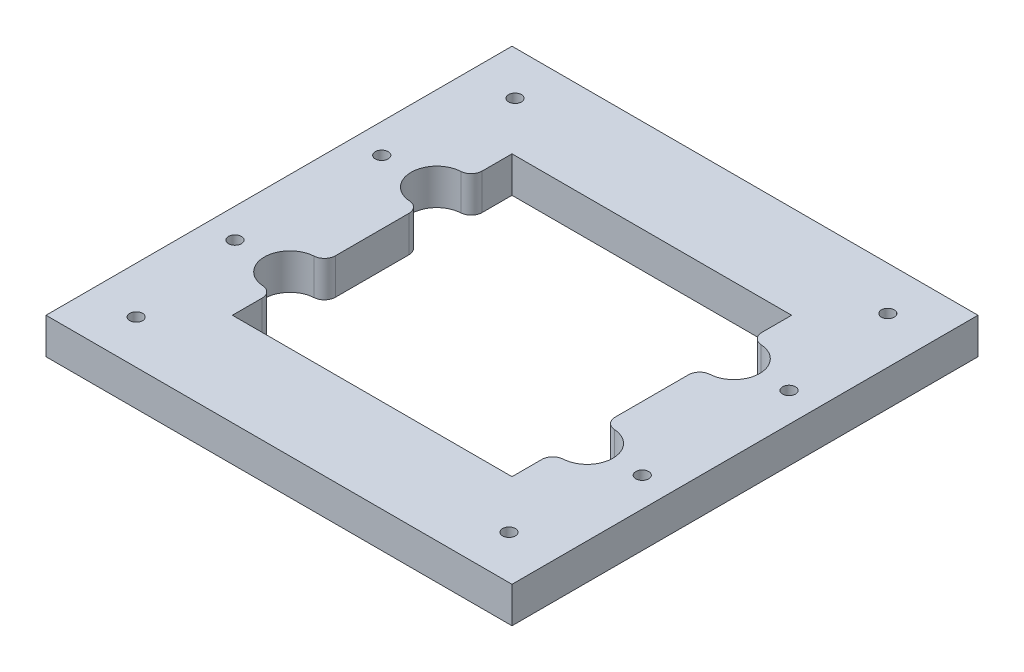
ISO-10303-21;
HEADER;
FILE_DESCRIPTION(('STEP AP214'),'2;1');
FILE_NAME('part.step','',(''),(''),'','','');
FILE_SCHEMA(('AUTOMOTIVE_DESIGN { 1 0 10303 214 1 1 1 1 }'));
ENDSEC;
DATA;
#1=APPLICATION_CONTEXT('core data for automotive mechanical design processes');
#2=APPLICATION_PROTOCOL_DEFINITION('international standard','automotive_design',2000,#1);
#3=PRODUCT_CONTEXT('',#1,'mechanical');
#4=PRODUCT('Part','Part','',(#3));
#5=PRODUCT_RELATED_PRODUCT_CATEGORY('part','',(#4));
#6=PRODUCT_DEFINITION_FORMATION('','',#4);
#7=PRODUCT_DEFINITION_CONTEXT('part definition',#1,'design');
#8=PRODUCT_DEFINITION('design','',#6,#7);
#9=PRODUCT_DEFINITION_SHAPE('','',#8);
#10=(LENGTH_UNIT() NAMED_UNIT(*) SI_UNIT(.MILLI.,.METRE.));
#11=(NAMED_UNIT(*) PLANE_ANGLE_UNIT() SI_UNIT($,.RADIAN.));
#12=(NAMED_UNIT(*) SI_UNIT($,.STERADIAN.) SOLID_ANGLE_UNIT());
#13=UNCERTAINTY_MEASURE_WITH_UNIT(LENGTH_MEASURE(1.E-05),#10,'distance_accuracy_value','');
#14=(GEOMETRIC_REPRESENTATION_CONTEXT(3) GLOBAL_UNCERTAINTY_ASSIGNED_CONTEXT((#13)) GLOBAL_UNIT_ASSIGNED_CONTEXT((#10,
#11,#12)) REPRESENTATION_CONTEXT('',''));
#15=CARTESIAN_POINT('',(0.,0.,0.));
#16=DIRECTION('',(0.,0.,1.));
#17=DIRECTION('',(1.,0.,0.));
#18=AXIS2_PLACEMENT_3D('',#15,#16,#17);
#19=CARTESIAN_POINT('',(19.05,8.075,19.05));
#20=DIRECTION('',(-1.,0.,0.));
#21=DIRECTION('',(0.,0.,1.));
#22=AXIS2_PLACEMENT_3D('',#19,#20,#21);
#23=PLANE('',#22);
#24=DIRECTION('',(0.,0.,-1.));
#25=VECTOR('',#24,1.);
#26=CARTESIAN_POINT('',(19.05,3.175,19.05));
#27=LINE('',#26,#25);
#28=CARTESIAN_POINT('',(19.05,3.175,5.00900811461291));
#29=VERTEX_POINT('',#28);
#30=CARTESIAN_POINT('',(19.05,3.175,-5.0090081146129));
#31=VERTEX_POINT('',#30);
#32=EDGE_CURVE('E234',#29,#31,#27,.T.);
#33=ORIENTED_EDGE('',*,*,#32,.F.);
#34=DIRECTION('',(0.,-1.,0.));
#35=VECTOR('',#34,1.);
#36=CARTESIAN_POINT('',(19.05,8.075,5.0090081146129));
#37=LINE('',#36,#35);
#38=CARTESIAN_POINT('',(19.05,8.075,5.00900811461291));
#39=VERTEX_POINT('',#38);
#40=EDGE_CURVE('E354',#29,#39,#37,.F.);
#41=ORIENTED_EDGE('',*,*,#40,.T.);
#42=DIRECTION('',(0.,0.,-1.));
#43=VECTOR('',#42,1.);
#44=CARTESIAN_POINT('',(19.05,8.075,19.05));
#45=LINE('',#44,#43);
#46=CARTESIAN_POINT('',(19.05,8.075,-5.0090081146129));
#47=VERTEX_POINT('',#46);
#48=EDGE_CURVE('E202',#39,#47,#45,.T.);
#49=ORIENTED_EDGE('',*,*,#48,.T.);
#50=DIRECTION('',(0.,-1.,0.));
#51=VECTOR('',#50,1.);
#52=CARTESIAN_POINT('',(19.05,3.175,-5.00900811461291));
#53=LINE('',#52,#51);
#54=EDGE_CURVE('E352',#47,#31,#53,.T.);
#55=ORIENTED_EDGE('',*,*,#54,.T.);
#56=EDGE_LOOP('',(#33,#41,#49,#55));
#57=FACE_BOUND('',#56,.T.);
#58=ADVANCED_FACE('F30',(#57),#23,.T.);
#59=CARTESIAN_POINT('',(19.05,8.075,19.05));
#60=VERTEX_POINT('',#59);
#61=CARTESIAN_POINT('',(19.05,8.075,14.9909918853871));
#62=VERTEX_POINT('',#61);
#63=EDGE_CURVE('E205',#60,#62,#45,.T.);
#64=ORIENTED_EDGE('',*,*,#63,.T.);
#65=DIRECTION('',(0.,-1.,0.));
#66=VECTOR('',#65,1.);
#67=CARTESIAN_POINT('',(19.05,3.175,14.9909918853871));
#68=LINE('',#67,#66);
#69=CARTESIAN_POINT('',(19.05,3.175,14.9909918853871));
#70=VERTEX_POINT('',#69);
#71=EDGE_CURVE('E350',#62,#70,#68,.T.);
#72=ORIENTED_EDGE('',*,*,#71,.T.);
#73=CARTESIAN_POINT('',(19.05,3.175,19.05));
#74=VERTEX_POINT('',#73);
#75=EDGE_CURVE('E232',#74,#70,#27,.T.);
#76=ORIENTED_EDGE('',*,*,#75,.F.);
#77=DIRECTION('',(0.,-1.,0.));
#78=VECTOR('',#77,1.);
#79=CARTESIAN_POINT('',(19.05,8.075,19.05));
#80=LINE('',#79,#78);
#81=EDGE_CURVE('E231',#60,#74,#80,.T.);
#82=ORIENTED_EDGE('',*,*,#81,.F.);
#83=EDGE_LOOP('',(#64,#72,#76,#82));
#84=FACE_BOUND('',#83,.T.);
#85=ADVANCED_FACE('F462',(#84),#23,.T.);
#86=CARTESIAN_POINT('',(-19.05,8.075,19.05));
#87=DIRECTION('',(1.,0.,0.));
#88=DIRECTION('',(0.,0.,-1.));
#89=AXIS2_PLACEMENT_3D('',#86,#87,#88);
#90=PLANE('',#89);
#91=DIRECTION('',(0.,0.,1.));
#92=VECTOR('',#91,1.);
#93=CARTESIAN_POINT('',(-19.05,3.175,19.05));
#94=LINE('',#93,#92);
#95=CARTESIAN_POINT('',(-19.05,3.175,-5.0090081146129));
#96=VERTEX_POINT('',#95);
#97=CARTESIAN_POINT('',(-19.05,3.175,5.0090081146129));
#98=VERTEX_POINT('',#97);
#99=EDGE_CURVE('E241',#96,#98,#94,.T.);
#100=ORIENTED_EDGE('',*,*,#99,.F.);
#101=DIRECTION('',(0.,-1.,0.));
#102=VECTOR('',#101,1.);
#103=CARTESIAN_POINT('',(-19.05,8.075,-5.00900811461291));
#104=LINE('',#103,#102);
#105=CARTESIAN_POINT('',(-19.05,8.075,-5.0090081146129));
#106=VERTEX_POINT('',#105);
#107=EDGE_CURVE('E335',#96,#106,#104,.F.);
#108=ORIENTED_EDGE('',*,*,#107,.T.);
#109=DIRECTION('',(0.,0.,1.));
#110=VECTOR('',#109,1.);
#111=CARTESIAN_POINT('',(-19.05,8.075,19.05));
#112=LINE('',#111,#110);
#113=CARTESIAN_POINT('',(-19.05,8.075,5.0090081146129));
#114=VERTEX_POINT('',#113);
#115=EDGE_CURVE('E224',#106,#114,#112,.T.);
#116=ORIENTED_EDGE('',*,*,#115,.T.);
#117=DIRECTION('',(0.,-1.,0.));
#118=VECTOR('',#117,1.);
#119=CARTESIAN_POINT('',(-19.05,3.175,5.0090081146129));
#120=LINE('',#119,#118);
#121=EDGE_CURVE('E333',#114,#98,#120,.T.);
#122=ORIENTED_EDGE('',*,*,#121,.T.);
#123=EDGE_LOOP('',(#100,#108,#116,#122));
#124=FACE_BOUND('',#123,.T.);
#125=ADVANCED_FACE('F468',(#124),#90,.T.);
#126=CARTESIAN_POINT('',(-19.05,8.075,-19.05));
#127=VERTEX_POINT('',#126);
#128=CARTESIAN_POINT('',(-19.05,8.075,-14.9909918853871));
#129=VERTEX_POINT('',#128);
#130=EDGE_CURVE('E221',#127,#129,#112,.T.);
#131=ORIENTED_EDGE('',*,*,#130,.T.);
#132=DIRECTION('',(0.,-1.,0.));
#133=VECTOR('',#132,1.);
#134=CARTESIAN_POINT('',(-19.05,3.175,-14.9909918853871));
#135=LINE('',#134,#133);
#136=CARTESIAN_POINT('',(-19.05,3.175,-14.9909918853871));
#137=VERTEX_POINT('',#136);
#138=EDGE_CURVE('E317',#129,#137,#135,.T.);
#139=ORIENTED_EDGE('',*,*,#138,.T.);
#140=CARTESIAN_POINT('',(-19.05,3.175,-19.05));
#141=VERTEX_POINT('',#140);
#142=EDGE_CURVE('E238',#141,#137,#94,.T.);
#143=ORIENTED_EDGE('',*,*,#142,.F.);
#144=DIRECTION('',(0.,-1.,0.));
#145=VECTOR('',#144,1.);
#146=CARTESIAN_POINT('',(-19.05,8.075,-19.05));
#147=LINE('',#146,#145);
#148=EDGE_CURVE('E214',#127,#141,#147,.T.);
#149=ORIENTED_EDGE('',*,*,#148,.F.);
#150=EDGE_LOOP('',(#131,#139,#143,#149));
#151=FACE_BOUND('',#150,.T.);
#152=ADVANCED_FACE('F430',(#151),#90,.T.);
#153=CARTESIAN_POINT('',(-31.75,8.075,31.75));
#154=DIRECTION('',(0.,1.,0.));
#155=DIRECTION('',(0.,0.,1.));
#156=AXIS2_PLACEMENT_3D('',#153,#154,#155);
#157=PLANE('',#156);
#158=CARTESIAN_POINT('',(-20.25,8.075,-10.));
#159=DIRECTION('',(0.,1.,0.));
#160=DIRECTION('',(0.,0.,1.));
#161=AXIS2_PLACEMENT_3D('',#158,#159,#160);
#162=CIRCLE('',#161,3.5);
#163=CARTESIAN_POINT('',(-20.46,8.075,-13.493694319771));
#164=VERTEX_POINT('',#163);
#165=CARTESIAN_POINT('',(-20.46,8.075,-6.50630568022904));
#166=VERTEX_POINT('',#165);
#167=EDGE_CURVE('E387',#164,#166,#162,.T.);
#168=ORIENTED_EDGE('',*,*,#167,.F.);
#169=CARTESIAN_POINT('',(-20.55,8.075,-14.9909918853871));
#170=DIRECTION('',(0.,1.,0.));
#171=DIRECTION('',(0.,0.,1.));
#172=AXIS2_PLACEMENT_3D('',#169,#170,#171);
#173=CIRCLE('',#172,1.5);
#174=EDGE_CURVE('E315',#164,#129,#173,.T.);
#175=ORIENTED_EDGE('',*,*,#174,.T.);
#176=ORIENTED_EDGE('',*,*,#130,.F.);
#177=DIRECTION('',(-1.,0.,0.));
#178=VECTOR('',#177,1.);
#179=CARTESIAN_POINT('',(19.05,8.075,-19.05));
#180=LINE('',#179,#178);
#181=CARTESIAN_POINT('',(19.05,8.075,-19.05));
#182=VERTEX_POINT('',#181);
#183=EDGE_CURVE('E209',#182,#127,#180,.T.);
#184=ORIENTED_EDGE('',*,*,#183,.F.);
#185=CARTESIAN_POINT('',(19.05,8.075,-14.9909918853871));
#186=VERTEX_POINT('',#185);
#187=EDGE_CURVE('E193',#186,#182,#45,.T.);
#188=ORIENTED_EDGE('',*,*,#187,.F.);
#189=CARTESIAN_POINT('',(20.55,8.075,-14.9909918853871));
#190=DIRECTION('',(0.,1.,0.));
#191=DIRECTION('',(0.,0.,1.));
#192=AXIS2_PLACEMENT_3D('',#189,#190,#191);
#193=CIRCLE('',#192,1.5);
#194=CARTESIAN_POINT('',(20.46,8.075,-13.493694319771));
#195=VERTEX_POINT('',#194);
#196=EDGE_CURVE('E303',#186,#195,#193,.T.);
#197=ORIENTED_EDGE('',*,*,#196,.T.);
#198=CARTESIAN_POINT('',(20.25,8.075,-10.));
#199=DIRECTION('',(0.,1.,0.));
#200=DIRECTION('',(0.,0.,1.));
#201=AXIS2_PLACEMENT_3D('',#198,#199,#200);
#202=CIRCLE('',#201,3.5);
#203=CARTESIAN_POINT('',(20.46,8.075,-6.50630568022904));
#204=VERTEX_POINT('',#203);
#205=EDGE_CURVE('E368',#204,#195,#202,.T.);
#206=ORIENTED_EDGE('',*,*,#205,.F.);
#207=CARTESIAN_POINT('',(20.55,8.075,-5.00900811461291));
#208=DIRECTION('',(0.,1.,0.));
#209=DIRECTION('',(0.,0.,1.));
#210=AXIS2_PLACEMENT_3D('',#207,#208,#209);
#211=CIRCLE('',#210,1.5);
#212=EDGE_CURVE('E301',#204,#47,#211,.T.);
#213=ORIENTED_EDGE('',*,*,#212,.T.);
#214=ORIENTED_EDGE('',*,*,#48,.F.);
#215=CARTESIAN_POINT('',(20.55,8.075,5.0090081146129));
#216=DIRECTION('',(0.,1.,0.));
#217=DIRECTION('',(0.,0.,1.));
#218=AXIS2_PLACEMENT_3D('',#215,#216,#217);
#219=CIRCLE('',#218,1.5);
#220=CARTESIAN_POINT('',(20.46,8.075,6.50630568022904));
#221=VERTEX_POINT('',#220);
#222=EDGE_CURVE('E305',#39,#221,#219,.T.);
#223=ORIENTED_EDGE('',*,*,#222,.T.);
#224=CARTESIAN_POINT('',(20.25,8.075,10.));
#225=DIRECTION('',(0.,1.,0.));
#226=DIRECTION('',(0.,0.,1.));
#227=AXIS2_PLACEMENT_3D('',#224,#225,#226);
#228=CIRCLE('',#227,3.5);
#229=CARTESIAN_POINT('',(20.46,8.075,13.493694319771));
#230=VERTEX_POINT('',#229);
#231=EDGE_CURVE('E373',#230,#221,#228,.T.);
#232=ORIENTED_EDGE('',*,*,#231,.F.);
#233=CARTESIAN_POINT('',(20.55,8.075,14.9909918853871));
#234=DIRECTION('',(0.,1.,0.));
#235=DIRECTION('',(0.,0.,1.));
#236=AXIS2_PLACEMENT_3D('',#233,#234,#235);
#237=CIRCLE('',#236,1.5);
#238=EDGE_CURVE('E307',#230,#62,#237,.T.);
#239=ORIENTED_EDGE('',*,*,#238,.T.);
#240=ORIENTED_EDGE('',*,*,#63,.F.);
#241=DIRECTION('',(1.,0.,0.));
#242=VECTOR('',#241,1.);
#243=CARTESIAN_POINT('',(19.05,8.075,19.05));
#244=LINE('',#243,#242);
#245=CARTESIAN_POINT('',(-19.05,8.075,19.05));
#246=VERTEX_POINT('',#245);
#247=EDGE_CURVE('E229',#246,#60,#244,.T.);
#248=ORIENTED_EDGE('',*,*,#247,.F.);
#249=CARTESIAN_POINT('',(-19.05,8.075,14.9909918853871));
#250=VERTEX_POINT('',#249);
#251=EDGE_CURVE('E222',#250,#246,#112,.T.);
#252=ORIENTED_EDGE('',*,*,#251,.F.);
#253=CARTESIAN_POINT('',(-20.55,8.075,14.9909918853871));
#254=DIRECTION('',(0.,1.,0.));
#255=DIRECTION('',(0.,0.,1.));
#256=AXIS2_PLACEMENT_3D('',#253,#254,#255);
#257=CIRCLE('',#256,1.5);
#258=CARTESIAN_POINT('',(-20.46,8.075,13.493694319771));
#259=VERTEX_POINT('',#258);
#260=EDGE_CURVE('E309',#250,#259,#257,.T.);
#261=ORIENTED_EDGE('',*,*,#260,.T.);
#262=CARTESIAN_POINT('',(-20.25,8.075,10.));
#263=DIRECTION('',(0.,1.,0.));
#264=DIRECTION('',(0.,0.,1.));
#265=AXIS2_PLACEMENT_3D('',#262,#263,#264);
#266=CIRCLE('',#265,3.5);
#267=CARTESIAN_POINT('',(-20.46,8.075,6.50630568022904));
#268=VERTEX_POINT('',#267);
#269=EDGE_CURVE('E381',#268,#259,#266,.T.);
#270=ORIENTED_EDGE('',*,*,#269,.F.);
#271=CARTESIAN_POINT('',(-20.55,8.075,5.0090081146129));
#272=DIRECTION('',(0.,1.,0.));
#273=DIRECTION('',(0.,0.,1.));
#274=AXIS2_PLACEMENT_3D('',#271,#272,#273);
#275=CIRCLE('',#274,1.5);
#276=EDGE_CURVE('E311',#268,#114,#275,.T.);
#277=ORIENTED_EDGE('',*,*,#276,.T.);
#278=ORIENTED_EDGE('',*,*,#115,.F.);
#279=CARTESIAN_POINT('',(-20.55,8.075,-5.00900811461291));
#280=DIRECTION('',(0.,1.,0.));
#281=DIRECTION('',(0.,0.,1.));
#282=AXIS2_PLACEMENT_3D('',#279,#280,#281);
#283=CIRCLE('',#282,1.5);
#284=EDGE_CURVE('E313',#106,#166,#283,.T.);
#285=ORIENTED_EDGE('',*,*,#284,.T.);
#286=EDGE_LOOP('',(#168,#175,#176,#184,#188,#197,#206,#213,#214,#223,#232,#239,#240,#248,#252,
#261,#270,#277,#278,#285));
#287=FACE_BOUND('',#286,.T.);
#288=CARTESIAN_POINT('',(-27.75,8.075,-10.));
#289=DIRECTION('',(0.,1.,0.));
#290=DIRECTION('',(0.,0.,1.));
#291=AXIS2_PLACEMENT_3D('',#288,#289,#290);
#292=CIRCLE('',#291,0.875000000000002);
#293=CARTESIAN_POINT('',(-27.75,8.075,-10.875));
#294=VERTEX_POINT('',#293);
#295=EDGE_CURVE('E396',#294,#294,#292,.T.);
#296=ORIENTED_EDGE('',*,*,#295,.F.);
#297=EDGE_LOOP('',(#296));
#298=FACE_BOUND('',#297,.T.);
#299=CARTESIAN_POINT('',(27.75,8.075,-10.));
#300=DIRECTION('',(0.,1.,0.));
#301=DIRECTION('',(0.,0.,1.));
#302=AXIS2_PLACEMENT_3D('',#299,#300,#301);
#303=CIRCLE('',#302,0.875000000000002);
#304=CARTESIAN_POINT('',(27.75,8.075,-10.875));
#305=VERTEX_POINT('',#304);
#306=EDGE_CURVE('E402',#305,#305,#303,.T.);
#307=ORIENTED_EDGE('',*,*,#306,.F.);
#308=EDGE_LOOP('',(#307));
#309=FACE_BOUND('',#308,.T.);
#310=CARTESIAN_POINT('',(27.75,8.075,10.));
#311=DIRECTION('',(0.,1.,0.));
#312=DIRECTION('',(0.,0.,1.));
#313=AXIS2_PLACEMENT_3D('',#310,#311,#312);
#314=CIRCLE('',#313,0.875000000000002);
#315=CARTESIAN_POINT('',(27.75,8.075,9.125));
#316=VERTEX_POINT('',#315);
#317=EDGE_CURVE('E408',#316,#316,#314,.T.);
#318=ORIENTED_EDGE('',*,*,#317,.F.);
#319=EDGE_LOOP('',(#318));
#320=FACE_BOUND('',#319,.T.);
#321=CARTESIAN_POINT('',(-27.75,8.075,10.));
#322=DIRECTION('',(0.,1.,0.));
#323=DIRECTION('',(0.,0.,1.));
#324=AXIS2_PLACEMENT_3D('',#321,#322,#323);
#325=CIRCLE('',#324,0.875000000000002);
#326=CARTESIAN_POINT('',(-27.75,8.075,9.125));
#327=VERTEX_POINT('',#326);
#328=EDGE_CURVE('E414',#327,#327,#325,.T.);
#329=ORIENTED_EDGE('',*,*,#328,.F.);
#330=EDGE_LOOP('',(#329));
#331=FACE_BOUND('',#330,.T.);
#332=CARTESIAN_POINT('',(-25.4,8.075,25.8125));
#333=DIRECTION('',(0.,1.,0.));
#334=DIRECTION('',(0.,0.,1.));
#335=AXIS2_PLACEMENT_3D('',#332,#333,#334);
#336=CIRCLE('',#335,0.875000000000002);
#337=CARTESIAN_POINT('',(-25.4,8.075,26.6875));
#338=VERTEX_POINT('',#337);
#339=EDGE_CURVE('E295',#338,#338,#336,.T.);
#340=ORIENTED_EDGE('',*,*,#339,.F.);
#341=EDGE_LOOP('',(#340));
#342=FACE_BOUND('',#341,.T.);
#343=CARTESIAN_POINT('',(25.4,8.075,25.8125));
#344=DIRECTION('',(0.,1.,0.));
#345=DIRECTION('',(0.,0.,1.));
#346=AXIS2_PLACEMENT_3D('',#343,#344,#345);
#347=CIRCLE('',#346,0.875000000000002);
#348=CARTESIAN_POINT('',(25.4,8.075,26.6875));
#349=VERTEX_POINT('',#348);
#350=EDGE_CURVE('E291',#349,#349,#347,.T.);
#351=ORIENTED_EDGE('',*,*,#350,.F.);
#352=EDGE_LOOP('',(#351));
#353=FACE_BOUND('',#352,.T.);
#354=CARTESIAN_POINT('',(25.4,8.075,-25.8125));
#355=DIRECTION('',(0.,1.,0.));
#356=DIRECTION('',(0.,0.,1.));
#357=AXIS2_PLACEMENT_3D('',#354,#355,#356);
#358=CIRCLE('',#357,0.875000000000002);
#359=CARTESIAN_POINT('',(25.4,8.075,-24.9375));
#360=VERTEX_POINT('',#359);
#361=EDGE_CURVE('E287',#360,#360,#358,.T.);
#362=ORIENTED_EDGE('',*,*,#361,.F.);
#363=EDGE_LOOP('',(#362));
#364=FACE_BOUND('',#363,.T.);
#365=CARTESIAN_POINT('',(-25.4,8.075,-25.8125));
#366=DIRECTION('',(0.,1.,0.));
#367=DIRECTION('',(0.,0.,1.));
#368=AXIS2_PLACEMENT_3D('',#365,#366,#367);
#369=CIRCLE('',#368,0.875000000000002);
#370=CARTESIAN_POINT('',(-25.4,8.075,-24.9375));
#371=VERTEX_POINT('',#370);
#372=EDGE_CURVE('E283',#371,#371,#369,.T.);
#373=ORIENTED_EDGE('',*,*,#372,.F.);
#374=EDGE_LOOP('',(#373));
#375=FACE_BOUND('',#374,.T.);
#376=DIRECTION('',(0.,0.,1.));
#377=VECTOR('',#376,1.);
#378=CARTESIAN_POINT('',(-31.75,8.075,-31.75));
#379=LINE('',#378,#377);
#380=CARTESIAN_POINT('',(-31.75,8.075,-31.75));
#381=VERTEX_POINT('',#380);
#382=CARTESIAN_POINT('',(-31.75,8.075,31.75));
#383=VERTEX_POINT('',#382);
#384=EDGE_CURVE('E250',#381,#383,#379,.T.);
#385=ORIENTED_EDGE('',*,*,#384,.T.);
#386=DIRECTION('',(1.,0.,0.));
#387=VECTOR('',#386,1.);
#388=CARTESIAN_POINT('',(-31.75,8.075,31.75));
#389=LINE('',#388,#387);
#390=CARTESIAN_POINT('',(31.75,8.075,31.75));
#391=VERTEX_POINT('',#390);
#392=EDGE_CURVE('E253',#383,#391,#389,.T.);
#393=ORIENTED_EDGE('',*,*,#392,.T.);
#394=DIRECTION('',(0.,0.,-1.));
#395=VECTOR('',#394,1.);
#396=CARTESIAN_POINT('',(31.75,8.075,-31.75));
#397=LINE('',#396,#395);
#398=CARTESIAN_POINT('',(31.75,8.075,-31.75));
#399=VERTEX_POINT('',#398);
#400=EDGE_CURVE('E256',#391,#399,#397,.T.);
#401=ORIENTED_EDGE('',*,*,#400,.T.);
#402=DIRECTION('',(-1.,0.,0.));
#403=VECTOR('',#402,1.);
#404=CARTESIAN_POINT('',(-31.75,8.075,-31.75));
#405=LINE('',#404,#403);
#406=EDGE_CURVE('E258',#399,#381,#405,.T.);
#407=ORIENTED_EDGE('',*,*,#406,.T.);
#408=EDGE_LOOP('',(#385,#393,#401,#407));
#409=FACE_BOUND('',#408,.T.);
#410=ADVANCED_FACE('F218',(#287,#298,#309,#320,#331,#342,#353,#364,#375,#409),#157,.T.);
#411=CARTESIAN_POINT('',(-31.75,3.175,31.75));
#412=DIRECTION('',(0.,1.,0.));
#413=DIRECTION('',(0.,0.,1.));
#414=AXIS2_PLACEMENT_3D('',#411,#412,#413);
#415=PLANE('',#414);
#416=CARTESIAN_POINT('',(-27.75,3.175,-10.));
#417=DIRECTION('',(0.,-1.,0.));
#418=DIRECTION('',(0.,0.,-1.));
#419=AXIS2_PLACEMENT_3D('',#416,#417,#418);
#420=CIRCLE('',#419,0.875000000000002);
#421=CARTESIAN_POINT('',(-27.75,3.17499999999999,-10.875));
#422=VERTEX_POINT('',#421);
#423=EDGE_CURVE('E393',#422,#422,#420,.T.);
#424=ORIENTED_EDGE('',*,*,#423,.F.);
#425=EDGE_LOOP('',(#424));
#426=FACE_BOUND('',#425,.T.);
#427=CARTESIAN_POINT('',(27.75,3.175,-10.));
#428=DIRECTION('',(0.,-1.,0.));
#429=DIRECTION('',(0.,0.,-1.));
#430=AXIS2_PLACEMENT_3D('',#427,#428,#429);
#431=CIRCLE('',#430,0.875000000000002);
#432=CARTESIAN_POINT('',(27.75,3.17499999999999,-10.875));
#433=VERTEX_POINT('',#432);
#434=EDGE_CURVE('E399',#433,#433,#431,.T.);
#435=ORIENTED_EDGE('',*,*,#434,.F.);
#436=EDGE_LOOP('',(#435));
#437=FACE_BOUND('',#436,.T.);
#438=CARTESIAN_POINT('',(27.75,3.175,10.));
#439=DIRECTION('',(0.,-1.,0.));
#440=DIRECTION('',(0.,0.,-1.));
#441=AXIS2_PLACEMENT_3D('',#438,#439,#440);
#442=CIRCLE('',#441,0.875000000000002);
#443=CARTESIAN_POINT('',(27.75,3.17499999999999,9.125));
#444=VERTEX_POINT('',#443);
#445=EDGE_CURVE('E405',#444,#444,#442,.T.);
#446=ORIENTED_EDGE('',*,*,#445,.F.);
#447=EDGE_LOOP('',(#446));
#448=FACE_BOUND('',#447,.T.);
#449=CARTESIAN_POINT('',(-27.75,3.175,10.));
#450=DIRECTION('',(0.,-1.,0.));
#451=DIRECTION('',(0.,0.,-1.));
#452=AXIS2_PLACEMENT_3D('',#449,#450,#451);
#453=CIRCLE('',#452,0.875000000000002);
#454=CARTESIAN_POINT('',(-27.75,3.17499999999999,9.125));
#455=VERTEX_POINT('',#454);
#456=EDGE_CURVE('E411',#455,#455,#453,.T.);
#457=ORIENTED_EDGE('',*,*,#456,.F.);
#458=EDGE_LOOP('',(#457));
#459=FACE_BOUND('',#458,.T.);
#460=CARTESIAN_POINT('',(-25.4,3.175,25.8125));
#461=DIRECTION('',(0.,1.,0.));
#462=DIRECTION('',(0.,0.,1.));
#463=AXIS2_PLACEMENT_3D('',#460,#461,#462);
#464=CIRCLE('',#463,0.875000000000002);
#465=CARTESIAN_POINT('',(-25.4,3.175,26.6875));
#466=VERTEX_POINT('',#465);
#467=EDGE_CURVE('E292',#466,#466,#464,.T.);
#468=ORIENTED_EDGE('',*,*,#467,.T.);
#469=EDGE_LOOP('',(#468));
#470=FACE_BOUND('',#469,.T.);
#471=CARTESIAN_POINT('',(25.4,3.175,25.8125));
#472=DIRECTION('',(0.,1.,0.));
#473=DIRECTION('',(0.,0.,1.));
#474=AXIS2_PLACEMENT_3D('',#471,#472,#473);
#475=CIRCLE('',#474,0.875000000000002);
#476=CARTESIAN_POINT('',(25.4,3.175,26.6875));
#477=VERTEX_POINT('',#476);
#478=EDGE_CURVE('E288',#477,#477,#475,.T.);
#479=ORIENTED_EDGE('',*,*,#478,.T.);
#480=EDGE_LOOP('',(#479));
#481=FACE_BOUND('',#480,.T.);
#482=CARTESIAN_POINT('',(25.4,3.175,-25.8125));
#483=DIRECTION('',(0.,1.,0.));
#484=DIRECTION('',(0.,0.,1.));
#485=AXIS2_PLACEMENT_3D('',#482,#483,#484);
#486=CIRCLE('',#485,0.875000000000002);
#487=CARTESIAN_POINT('',(25.4,3.175,-24.9375));
#488=VERTEX_POINT('',#487);
#489=EDGE_CURVE('E284',#488,#488,#486,.T.);
#490=ORIENTED_EDGE('',*,*,#489,.T.);
#491=EDGE_LOOP('',(#490));
#492=FACE_BOUND('',#491,.T.);
#493=CARTESIAN_POINT('',(-25.4,3.175,-25.8125));
#494=DIRECTION('',(0.,1.,0.));
#495=DIRECTION('',(0.,0.,1.));
#496=AXIS2_PLACEMENT_3D('',#493,#494,#495);
#497=CIRCLE('',#496,0.875000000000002);
#498=CARTESIAN_POINT('',(-25.4,3.175,-24.9375));
#499=VERTEX_POINT('',#498);
#500=EDGE_CURVE('E280',#499,#499,#497,.T.);
#501=ORIENTED_EDGE('',*,*,#500,.T.);
#502=EDGE_LOOP('',(#501));
#503=FACE_BOUND('',#502,.T.);
#504=DIRECTION('',(0.,0.,1.));
#505=VECTOR('',#504,1.);
#506=CARTESIAN_POINT('',(-31.75,3.175,-31.75));
#507=LINE('',#506,#505);
#508=CARTESIAN_POINT('',(-31.75,3.175,-31.75));
#509=VERTEX_POINT('',#508);
#510=CARTESIAN_POINT('',(-31.75,3.175,31.75));
#511=VERTEX_POINT('',#510);
#512=EDGE_CURVE('E213',#509,#511,#507,.T.);
#513=ORIENTED_EDGE('',*,*,#512,.F.);
#514=DIRECTION('',(-1.,0.,0.));
#515=VECTOR('',#514,1.);
#516=CARTESIAN_POINT('',(-31.75,3.175,-31.75));
#517=LINE('',#516,#515);
#518=CARTESIAN_POINT('',(31.75,3.175,-31.75));
#519=VERTEX_POINT('',#518);
#520=EDGE_CURVE('E254',#519,#509,#517,.T.);
#521=ORIENTED_EDGE('',*,*,#520,.F.);
#522=DIRECTION('',(0.,0.,-1.));
#523=VECTOR('',#522,1.);
#524=CARTESIAN_POINT('',(31.75,3.175,-31.75));
#525=LINE('',#524,#523);
#526=CARTESIAN_POINT('',(31.75,3.175,31.75));
#527=VERTEX_POINT('',#526);
#528=EDGE_CURVE('E265',#527,#519,#525,.T.);
#529=ORIENTED_EDGE('',*,*,#528,.F.);
#530=DIRECTION('',(1.,0.,0.));
#531=VECTOR('',#530,1.);
#532=CARTESIAN_POINT('',(-31.75,3.175,31.75));
#533=LINE('',#532,#531);
#534=EDGE_CURVE('E263',#511,#527,#533,.T.);
#535=ORIENTED_EDGE('',*,*,#534,.F.);
#536=EDGE_LOOP('',(#513,#521,#529,#535));
#537=FACE_BOUND('',#536,.T.);
#538=ORIENTED_EDGE('',*,*,#142,.T.);
#539=CARTESIAN_POINT('',(-20.55,3.175,-14.9909918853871));
#540=DIRECTION('',(0.,1.,0.));
#541=DIRECTION('',(0.,0.,1.));
#542=AXIS2_PLACEMENT_3D('',#539,#540,#541);
#543=CIRCLE('',#542,1.5);
#544=CARTESIAN_POINT('',(-20.46,3.175,-13.493694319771));
#545=VERTEX_POINT('',#544);
#546=EDGE_CURVE('E331',#137,#545,#543,.F.);
#547=ORIENTED_EDGE('',*,*,#546,.T.);
#548=CARTESIAN_POINT('',(-20.25,3.175,-10.));
#549=DIRECTION('',(0.,1.,0.));
#550=DIRECTION('',(0.,0.,1.));
#551=AXIS2_PLACEMENT_3D('',#548,#549,#550);
#552=CIRCLE('',#551,3.5);
#553=CARTESIAN_POINT('',(-20.46,3.175,-6.50630568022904));
#554=VERTEX_POINT('',#553);
#555=EDGE_CURVE('E390',#545,#554,#552,.T.);
#556=ORIENTED_EDGE('',*,*,#555,.T.);
#557=CARTESIAN_POINT('',(-20.55,3.175,-5.00900811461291));
#558=DIRECTION('',(0.,1.,0.));
#559=DIRECTION('',(0.,0.,1.));
#560=AXIS2_PLACEMENT_3D('',#557,#558,#559);
#561=CIRCLE('',#560,1.5);
#562=EDGE_CURVE('E329',#554,#96,#561,.F.);
#563=ORIENTED_EDGE('',*,*,#562,.T.);
#564=ORIENTED_EDGE('',*,*,#99,.T.);
#565=CARTESIAN_POINT('',(-20.55,3.175,5.0090081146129));
#566=DIRECTION('',(0.,1.,0.));
#567=DIRECTION('',(0.,0.,1.));
#568=AXIS2_PLACEMENT_3D('',#565,#566,#567);
#569=CIRCLE('',#568,1.5);
#570=CARTESIAN_POINT('',(-20.46,3.175,6.50630568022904));
#571=VERTEX_POINT('',#570);
#572=EDGE_CURVE('E327',#98,#571,#569,.F.);
#573=ORIENTED_EDGE('',*,*,#572,.T.);
#574=CARTESIAN_POINT('',(-20.25,3.175,10.));
#575=DIRECTION('',(0.,1.,0.));
#576=DIRECTION('',(0.,0.,1.));
#577=AXIS2_PLACEMENT_3D('',#574,#575,#576);
#578=CIRCLE('',#577,3.5);
#579=CARTESIAN_POINT('',(-20.46,3.175,13.493694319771));
#580=VERTEX_POINT('',#579);
#581=EDGE_CURVE('E384',#571,#580,#578,.T.);
#582=ORIENTED_EDGE('',*,*,#581,.T.);
#583=CARTESIAN_POINT('',(-20.55,3.175,14.9909918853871));
#584=DIRECTION('',(0.,1.,0.));
#585=DIRECTION('',(0.,0.,1.));
#586=AXIS2_PLACEMENT_3D('',#583,#584,#585);
#587=CIRCLE('',#586,1.5);
#588=CARTESIAN_POINT('',(-19.05,3.175,14.9909918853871));
#589=VERTEX_POINT('',#588);
#590=EDGE_CURVE('E325',#580,#589,#587,.F.);
#591=ORIENTED_EDGE('',*,*,#590,.T.);
#592=CARTESIAN_POINT('',(-19.05,3.175,19.05));
#593=VERTEX_POINT('',#592);
#594=EDGE_CURVE('E237',#589,#593,#94,.T.);
#595=ORIENTED_EDGE('',*,*,#594,.T.);
#596=DIRECTION('',(1.,0.,0.));
#597=VECTOR('',#596,1.);
#598=CARTESIAN_POINT('',(19.05,3.175,19.05));
#599=LINE('',#598,#597);
#600=EDGE_CURVE('E203',#593,#74,#599,.T.);
#601=ORIENTED_EDGE('',*,*,#600,.T.);
#602=ORIENTED_EDGE('',*,*,#75,.T.);
#603=CARTESIAN_POINT('',(20.55,3.175,14.9909918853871));
#604=DIRECTION('',(0.,1.,0.));
#605=DIRECTION('',(0.,0.,1.));
#606=AXIS2_PLACEMENT_3D('',#603,#604,#605);
#607=CIRCLE('',#606,1.5);
#608=CARTESIAN_POINT('',(20.46,3.175,13.493694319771));
#609=VERTEX_POINT('',#608);
#610=EDGE_CURVE('E53',#70,#609,#607,.F.);
#611=ORIENTED_EDGE('',*,*,#610,.T.);
#612=CARTESIAN_POINT('',(20.25,3.175,10.));
#613=DIRECTION('',(0.,1.,0.));
#614=DIRECTION('',(0.,0.,1.));
#615=AXIS2_PLACEMENT_3D('',#612,#613,#614);
#616=CIRCLE('',#615,3.5);
#617=CARTESIAN_POINT('',(20.46,3.175,6.50630568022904));
#618=VERTEX_POINT('',#617);
#619=EDGE_CURVE('E376',#609,#618,#616,.T.);
#620=ORIENTED_EDGE('',*,*,#619,.T.);
#621=CARTESIAN_POINT('',(20.55,3.175,5.0090081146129));
#622=DIRECTION('',(0.,1.,0.));
#623=DIRECTION('',(0.,0.,1.));
#624=AXIS2_PLACEMENT_3D('',#621,#622,#623);
#625=CIRCLE('',#624,1.5);
#626=EDGE_CURVE('E45',#618,#29,#625,.F.);
#627=ORIENTED_EDGE('',*,*,#626,.T.);
#628=ORIENTED_EDGE('',*,*,#32,.T.);
#629=CARTESIAN_POINT('',(20.55,3.175,-5.00900811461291));
#630=DIRECTION('',(0.,1.,0.));
#631=DIRECTION('',(0.,0.,1.));
#632=AXIS2_PLACEMENT_3D('',#629,#630,#631);
#633=CIRCLE('',#632,1.5);
#634=CARTESIAN_POINT('',(20.46,3.175,-6.50630568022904));
#635=VERTEX_POINT('',#634);
#636=EDGE_CURVE('E319',#31,#635,#633,.F.);
#637=ORIENTED_EDGE('',*,*,#636,.T.);
#638=CARTESIAN_POINT('',(20.25,3.175,-10.));
#639=DIRECTION('',(0.,1.,0.));
#640=DIRECTION('',(0.,0.,1.));
#641=AXIS2_PLACEMENT_3D('',#638,#639,#640);
#642=CIRCLE('',#641,3.5);
#643=CARTESIAN_POINT('',(20.46,3.175,-13.493694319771));
#644=VERTEX_POINT('',#643);
#645=EDGE_CURVE('E365',#635,#644,#642,.T.);
#646=ORIENTED_EDGE('',*,*,#645,.T.);
#647=CARTESIAN_POINT('',(20.55,3.175,-14.9909918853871));
#648=DIRECTION('',(0.,1.,0.));
#649=DIRECTION('',(0.,0.,1.));
#650=AXIS2_PLACEMENT_3D('',#647,#648,#649);
#651=CIRCLE('',#650,1.5);
#652=CARTESIAN_POINT('',(19.05,3.175,-14.9909918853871));
#653=VERTEX_POINT('',#652);
#654=EDGE_CURVE('E321',#644,#653,#651,.F.);
#655=ORIENTED_EDGE('',*,*,#654,.T.);
#656=CARTESIAN_POINT('',(19.05,3.175,-19.05));
#657=VERTEX_POINT('',#656);
#658=EDGE_CURVE('E235',#653,#657,#27,.T.);
#659=ORIENTED_EDGE('',*,*,#658,.T.);
#660=DIRECTION('',(-1.,0.,0.));
#661=VECTOR('',#660,1.);
#662=CARTESIAN_POINT('',(19.05,3.175,-19.05));
#663=LINE('',#662,#661);
#664=EDGE_CURVE('E212',#657,#141,#663,.T.);
#665=ORIENTED_EDGE('',*,*,#664,.T.);
#666=EDGE_LOOP('',(#538,#547,#556,#563,#564,#573,#582,#591,#595,#601,#602,#611,#620,#627,#628,
#637,#646,#655,#659,#665));
#667=FACE_BOUND('',#666,.T.);
#668=ADVANCED_FACE('F370',(#426,#437,#448,#459,#470,#481,#492,#503,#537,#667),#415,.F.);
#669=CARTESIAN_POINT('',(-31.75,8.075,-31.75));
#670=DIRECTION('',(1.,0.,0.));
#671=DIRECTION('',(0.,0.,-1.));
#672=AXIS2_PLACEMENT_3D('',#669,#670,#671);
#673=PLANE('',#672);
#674=ORIENTED_EDGE('',*,*,#512,.T.);
#675=DIRECTION('',(0.,-1.,0.));
#676=VECTOR('',#675,1.);
#677=CARTESIAN_POINT('',(-31.75,8.075,31.75));
#678=LINE('',#677,#676);
#679=EDGE_CURVE('E276',#383,#511,#678,.T.);
#680=ORIENTED_EDGE('',*,*,#679,.F.);
#681=ORIENTED_EDGE('',*,*,#384,.F.);
#682=DIRECTION('',(0.,-1.,0.));
#683=VECTOR('',#682,1.);
#684=CARTESIAN_POINT('',(-31.75,8.075,-31.75));
#685=LINE('',#684,#683);
#686=EDGE_CURVE('E260',#381,#509,#685,.T.);
#687=ORIENTED_EDGE('',*,*,#686,.T.);
#688=EDGE_LOOP('',(#674,#680,#681,#687));
#689=FACE_BOUND('',#688,.T.);
#690=ADVANCED_FACE('F438',(#689),#673,.F.);
#691=CARTESIAN_POINT('',(-31.75,8.075,31.75));
#692=DIRECTION('',(0.,0.,-1.));
#693=DIRECTION('',(-1.,0.,0.));
#694=AXIS2_PLACEMENT_3D('',#691,#692,#693);
#695=PLANE('',#694);
#696=ORIENTED_EDGE('',*,*,#534,.T.);
#697=DIRECTION('',(0.,-1.,0.));
#698=VECTOR('',#697,1.);
#699=CARTESIAN_POINT('',(31.75,8.075,31.75));
#700=LINE('',#699,#698);
#701=EDGE_CURVE('E273',#391,#527,#700,.T.);
#702=ORIENTED_EDGE('',*,*,#701,.F.);
#703=ORIENTED_EDGE('',*,*,#392,.F.);
#704=ORIENTED_EDGE('',*,*,#679,.T.);
#705=EDGE_LOOP('',(#696,#702,#703,#704));
#706=FACE_BOUND('',#705,.T.);
#707=ADVANCED_FACE('F441',(#706),#695,.F.);
#708=CARTESIAN_POINT('',(31.75,8.075,-31.75));
#709=DIRECTION('',(-1.,0.,0.));
#710=DIRECTION('',(0.,0.,1.));
#711=AXIS2_PLACEMENT_3D('',#708,#709,#710);
#712=PLANE('',#711);
#713=ORIENTED_EDGE('',*,*,#528,.T.);
#714=DIRECTION('',(0.,-1.,0.));
#715=VECTOR('',#714,1.);
#716=CARTESIAN_POINT('',(31.75,8.075,-31.75));
#717=LINE('',#716,#715);
#718=EDGE_CURVE('E270',#399,#519,#717,.T.);
#719=ORIENTED_EDGE('',*,*,#718,.F.);
#720=ORIENTED_EDGE('',*,*,#400,.F.);
#721=ORIENTED_EDGE('',*,*,#701,.T.);
#722=EDGE_LOOP('',(#713,#719,#720,#721));
#723=FACE_BOUND('',#722,.T.);
#724=ADVANCED_FACE('F446',(#723),#712,.F.);
#725=CARTESIAN_POINT('',(-31.75,8.075,-31.75));
#726=DIRECTION('',(0.,0.,1.));
#727=DIRECTION('',(1.,0.,0.));
#728=AXIS2_PLACEMENT_3D('',#725,#726,#727);
#729=PLANE('',#728);
#730=ORIENTED_EDGE('',*,*,#520,.T.);
#731=ORIENTED_EDGE('',*,*,#686,.F.);
#732=ORIENTED_EDGE('',*,*,#406,.F.);
#733=ORIENTED_EDGE('',*,*,#718,.T.);
#734=EDGE_LOOP('',(#730,#731,#732,#733));
#735=FACE_BOUND('',#734,.T.);
#736=ADVANCED_FACE('F449',(#735),#729,.F.);
#737=ORIENTED_EDGE('',*,*,#658,.F.);
#738=DIRECTION('',(0.,-1.,0.));
#739=VECTOR('',#738,1.);
#740=CARTESIAN_POINT('',(19.05,8.075,-14.9909918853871));
#741=LINE('',#740,#739);
#742=EDGE_CURVE('E11',#653,#186,#741,.F.);
#743=ORIENTED_EDGE('',*,*,#742,.T.);
#744=ORIENTED_EDGE('',*,*,#187,.T.);
#745=DIRECTION('',(0.,-1.,0.));
#746=VECTOR('',#745,1.);
#747=CARTESIAN_POINT('',(19.05,8.075,-19.05));
#748=LINE('',#747,#746);
#749=EDGE_CURVE('E197',#182,#657,#748,.T.);
#750=ORIENTED_EDGE('',*,*,#749,.T.);
#751=EDGE_LOOP('',(#737,#743,#744,#750));
#752=FACE_BOUND('',#751,.T.);
#753=ADVANCED_FACE('F196',(#752),#23,.T.);
#754=CARTESIAN_POINT('',(19.05,8.075,-19.05));
#755=DIRECTION('',(0.,0.,1.));
#756=DIRECTION('',(1.,0.,0.));
#757=AXIS2_PLACEMENT_3D('',#754,#755,#756);
#758=PLANE('',#757);
#759=ORIENTED_EDGE('',*,*,#664,.F.);
#760=ORIENTED_EDGE('',*,*,#749,.F.);
#761=ORIENTED_EDGE('',*,*,#183,.T.);
#762=ORIENTED_EDGE('',*,*,#148,.T.);
#763=EDGE_LOOP('',(#759,#760,#761,#762));
#764=FACE_BOUND('',#763,.T.);
#765=ADVANCED_FACE('F208',(#764),#758,.T.);
#766=ORIENTED_EDGE('',*,*,#594,.F.);
#767=DIRECTION('',(0.,-1.,0.));
#768=VECTOR('',#767,1.);
#769=CARTESIAN_POINT('',(-19.05,8.075,14.9909918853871));
#770=LINE('',#769,#768);
#771=EDGE_CURVE('E343',#589,#250,#770,.F.);
#772=ORIENTED_EDGE('',*,*,#771,.T.);
#773=ORIENTED_EDGE('',*,*,#251,.T.);
#774=DIRECTION('',(0.,-1.,0.));
#775=VECTOR('',#774,1.);
#776=CARTESIAN_POINT('',(-19.05,8.075,19.05));
#777=LINE('',#776,#775);
#778=EDGE_CURVE('E246',#246,#593,#777,.T.);
#779=ORIENTED_EDGE('',*,*,#778,.T.);
#780=EDGE_LOOP('',(#766,#772,#773,#779));
#781=FACE_BOUND('',#780,.T.);
#782=ADVANCED_FACE('F477',(#781),#90,.T.);
#783=CARTESIAN_POINT('',(19.05,8.075,19.05));
#784=DIRECTION('',(0.,0.,-1.));
#785=DIRECTION('',(-1.,0.,0.));
#786=AXIS2_PLACEMENT_3D('',#783,#784,#785);
#787=PLANE('',#786);
#788=ORIENTED_EDGE('',*,*,#600,.F.);
#789=ORIENTED_EDGE('',*,*,#778,.F.);
#790=ORIENTED_EDGE('',*,*,#247,.T.);
#791=ORIENTED_EDGE('',*,*,#81,.T.);
#792=EDGE_LOOP('',(#788,#789,#790,#791));
#793=FACE_BOUND('',#792,.T.);
#794=ADVANCED_FACE('F527',(#793),#787,.T.);
#795=CARTESIAN_POINT('',(-25.4,-40.386,-25.8125));
#796=DIRECTION('',(0.,1.,0.));
#797=DIRECTION('',(0.,0.,1.));
#798=AXIS2_PLACEMENT_3D('',#795,#796,#797);
#799=CYLINDRICAL_SURFACE('',#798,0.875000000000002);
#800=ORIENTED_EDGE('',*,*,#372,.T.);
#801=EDGE_LOOP('',(#800));
#802=FACE_BOUND('',#801,.T.);
#803=ORIENTED_EDGE('',*,*,#500,.F.);
#804=EDGE_LOOP('',(#803));
#805=FACE_BOUND('',#804,.T.);
#806=ADVANCED_FACE('F425',(#802,#805),#799,.F.);
#807=CARTESIAN_POINT('',(25.4,-40.386,-25.8125));
#808=DIRECTION('',(0.,1.,0.));
#809=DIRECTION('',(0.,0.,1.));
#810=AXIS2_PLACEMENT_3D('',#807,#808,#809);
#811=CYLINDRICAL_SURFACE('',#810,0.875000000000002);
#812=ORIENTED_EDGE('',*,*,#361,.T.);
#813=EDGE_LOOP('',(#812));
#814=FACE_BOUND('',#813,.T.);
#815=ORIENTED_EDGE('',*,*,#489,.F.);
#816=EDGE_LOOP('',(#815));
#817=FACE_BOUND('',#816,.T.);
#818=ADVANCED_FACE('F571',(#814,#817),#811,.F.);
#819=CARTESIAN_POINT('',(25.4,-40.386,25.8125));
#820=DIRECTION('',(0.,1.,0.));
#821=DIRECTION('',(0.,0.,1.));
#822=AXIS2_PLACEMENT_3D('',#819,#820,#821);
#823=CYLINDRICAL_SURFACE('',#822,0.875000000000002);
#824=ORIENTED_EDGE('',*,*,#350,.T.);
#825=EDGE_LOOP('',(#824));
#826=FACE_BOUND('',#825,.T.);
#827=ORIENTED_EDGE('',*,*,#478,.F.);
#828=EDGE_LOOP('',(#827));
#829=FACE_BOUND('',#828,.T.);
#830=ADVANCED_FACE('F576',(#826,#829),#823,.F.);
#831=CARTESIAN_POINT('',(-25.4,-40.386,25.8125));
#832=DIRECTION('',(0.,1.,0.));
#833=DIRECTION('',(0.,0.,1.));
#834=AXIS2_PLACEMENT_3D('',#831,#832,#833);
#835=CYLINDRICAL_SURFACE('',#834,0.875000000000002);
#836=ORIENTED_EDGE('',*,*,#339,.T.);
#837=EDGE_LOOP('',(#836));
#838=FACE_BOUND('',#837,.T.);
#839=ORIENTED_EDGE('',*,*,#467,.F.);
#840=EDGE_LOOP('',(#839));
#841=FACE_BOUND('',#840,.T.);
#842=ADVANCED_FACE('F580',(#838,#841),#835,.F.);
#843=CARTESIAN_POINT('',(-27.75,32.4875,10.));
#844=DIRECTION('',(0.,-1.,0.));
#845=DIRECTION('',(0.,0.,-1.));
#846=AXIS2_PLACEMENT_3D('',#843,#844,#845);
#847=CYLINDRICAL_SURFACE('',#846,0.875000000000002);
#848=CARTESIAN_POINT('',(-27.75,8.075,9.125));
#849=CARTESIAN_POINT('',(-27.75,8.02395833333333,9.125));
#850=CARTESIAN_POINT('',(-27.75,7.97291666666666,9.125));
#851=CARTESIAN_POINT('',(-27.75,7.87083333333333,9.125));
#852=CARTESIAN_POINT('',(-27.75,7.81979166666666,9.125));
#853=CARTESIAN_POINT('',(-27.75,7.71770833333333,9.125));
#854=CARTESIAN_POINT('',(-27.75,7.66666666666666,9.125));
#855=CARTESIAN_POINT('',(-27.75,7.56458333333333,9.125));
#856=CARTESIAN_POINT('',(-27.75,7.51354166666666,9.125));
#857=CARTESIAN_POINT('',(-27.75,7.41145833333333,9.125));
#858=CARTESIAN_POINT('',(-27.75,7.36041666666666,9.125));
#859=CARTESIAN_POINT('',(-27.75,7.25833333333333,9.125));
#860=CARTESIAN_POINT('',(-27.75,7.20729166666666,9.125));
#861=CARTESIAN_POINT('',(-27.75,7.10520833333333,9.125));
#862=CARTESIAN_POINT('',(-27.75,7.05416666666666,9.125));
#863=CARTESIAN_POINT('',(-27.75,6.95208333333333,9.125));
#864=CARTESIAN_POINT('',(-27.75,6.90104166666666,9.125));
#865=CARTESIAN_POINT('',(-27.75,6.79895833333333,9.125));
#866=CARTESIAN_POINT('',(-27.75,6.74791666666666,9.125));
#867=CARTESIAN_POINT('',(-27.75,6.64583333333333,9.125));
#868=CARTESIAN_POINT('',(-27.75,6.59479166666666,9.125));
#869=CARTESIAN_POINT('',(-27.75,6.49270833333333,9.125));
#870=CARTESIAN_POINT('',(-27.75,6.44166666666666,9.125));
#871=CARTESIAN_POINT('',(-27.75,6.33958333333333,9.125));
#872=CARTESIAN_POINT('',(-27.75,6.28854166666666,9.125));
#873=CARTESIAN_POINT('',(-27.75,6.18645833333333,9.125));
#874=CARTESIAN_POINT('',(-27.75,6.13541666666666,9.125));
#875=CARTESIAN_POINT('',(-27.75,6.03333333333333,9.125));
#876=CARTESIAN_POINT('',(-27.75,5.98229166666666,9.125));
#877=CARTESIAN_POINT('',(-27.75,5.88020833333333,9.125));
#878=CARTESIAN_POINT('',(-27.75,5.82916666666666,9.125));
#879=CARTESIAN_POINT('',(-27.75,5.72708333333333,9.125));
#880=CARTESIAN_POINT('',(-27.75,5.67604166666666,9.125));
#881=CARTESIAN_POINT('',(-27.75,5.57395833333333,9.125));
#882=CARTESIAN_POINT('',(-27.75,5.52291666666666,9.125));
#883=CARTESIAN_POINT('',(-27.75,5.42083333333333,9.125));
#884=CARTESIAN_POINT('',(-27.75,5.36979166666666,9.125));
#885=CARTESIAN_POINT('',(-27.75,5.26770833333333,9.125));
#886=CARTESIAN_POINT('',(-27.75,5.21666666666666,9.125));
#887=CARTESIAN_POINT('',(-27.75,5.11458333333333,9.125));
#888=CARTESIAN_POINT('',(-27.75,5.06354166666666,9.125));
#889=CARTESIAN_POINT('',(-27.75,4.96145833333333,9.125));
#890=CARTESIAN_POINT('',(-27.75,4.91041666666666,9.125));
#891=CARTESIAN_POINT('',(-27.75,4.80833333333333,9.125));
#892=CARTESIAN_POINT('',(-27.75,4.75729166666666,9.125));
#893=CARTESIAN_POINT('',(-27.75,4.65520833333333,9.125));
#894=CARTESIAN_POINT('',(-27.75,4.60416666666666,9.125));
#895=CARTESIAN_POINT('',(-27.75,4.50208333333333,9.125));
#896=CARTESIAN_POINT('',(-27.75,4.45104166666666,9.125));
#897=CARTESIAN_POINT('',(-27.75,4.34895833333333,9.125));
#898=CARTESIAN_POINT('',(-27.75,4.29791666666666,9.125));
#899=CARTESIAN_POINT('',(-27.75,4.19583333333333,9.125));
#900=CARTESIAN_POINT('',(-27.75,4.14479166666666,9.125));
#901=CARTESIAN_POINT('',(-27.75,4.04270833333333,9.125));
#902=CARTESIAN_POINT('',(-27.75,3.99166666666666,9.125));
#903=CARTESIAN_POINT('',(-27.75,3.88958333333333,9.125));
#904=CARTESIAN_POINT('',(-27.75,3.83854166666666,9.125));
#905=CARTESIAN_POINT('',(-27.75,3.73645833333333,9.125));
#906=CARTESIAN_POINT('',(-27.75,3.68541666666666,9.125));
#907=CARTESIAN_POINT('',(-27.75,3.58333333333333,9.125));
#908=CARTESIAN_POINT('',(-27.75,3.53229166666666,9.125));
#909=CARTESIAN_POINT('',(-27.75,3.43020833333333,9.125));
#910=CARTESIAN_POINT('',(-27.75,3.37916666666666,9.125));
#911=CARTESIAN_POINT('',(-27.75,3.27708333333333,9.125));
#912=CARTESIAN_POINT('',(-27.75,3.22604166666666,9.125));
#913=CARTESIAN_POINT('',(-27.75,3.17499999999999,9.125));
#914=B_SPLINE_CURVE_WITH_KNOTS('',3,(#848,#849,#850,#851,#852,#853,#854,#855,#856,#857,#858,
#859,#860,#861,#862,#863,#864,#865,#866,#867,#868,#869,#870,#871,#872,#873,#874,#875,#876,#877,
#878,#879,#880,#881,#882,#883,#884,#885,#886,#887,#888,#889,#890,#891,#892,#893,#894,#895,#896,
#897,#898,#899,#900,#901,#902,#903,#904,#905,#906,#907,#908,#909,#910,#911,#912,#913),
.UNSPECIFIED.,.F.,.F.,(4,2,2,2,2,2,2,2,2,2,2,2,2,2,2,2,2,2,2,2,2,2,2,2,2,2,2,2,2,2,2,2,4),(0.,
0.153125,0.306250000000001,0.459375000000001,0.612500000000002,0.765624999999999,
0.918749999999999,1.071875,1.225,1.378125,1.53125,1.684375,1.8375,1.990625,2.14375,2.296875,
2.45,2.603125,2.75625,2.909375,3.0625,3.215625,3.36875,3.521875,3.675,3.828125,3.98125,4.134375,
4.2875,4.440625,4.59375,4.746875,4.9),.UNSPECIFIED.);
#915=EDGE_CURVE('BSEAM584',#327,#455,#914,.T.);
#916=ORIENTED_EDGE('',*,*,#328,.T.);
#917=ORIENTED_EDGE('',*,*,#456,.T.);
#918=ORIENTED_EDGE('',*,*,#915,.T.);
#919=ORIENTED_EDGE('',*,*,#915,.F.);
#920=EDGE_LOOP('',(#916,#918,#917,#919));
#921=FACE_BOUND('',#920,.T.);
#922=ADVANCED_FACE('F584',(#921),#847,.F.);
#923=CARTESIAN_POINT('',(27.75,32.4875,10.));
#924=DIRECTION('',(0.,-1.,0.));
#925=DIRECTION('',(0.,0.,-1.));
#926=AXIS2_PLACEMENT_3D('',#923,#924,#925);
#927=CYLINDRICAL_SURFACE('',#926,0.875000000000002);
#928=CARTESIAN_POINT('',(27.75,8.075,9.125));
#929=CARTESIAN_POINT('',(27.75,8.02395833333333,9.125));
#930=CARTESIAN_POINT('',(27.75,7.97291666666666,9.125));
#931=CARTESIAN_POINT('',(27.75,7.87083333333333,9.125));
#932=CARTESIAN_POINT('',(27.75,7.81979166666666,9.125));
#933=CARTESIAN_POINT('',(27.75,7.71770833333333,9.125));
#934=CARTESIAN_POINT('',(27.75,7.66666666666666,9.125));
#935=CARTESIAN_POINT('',(27.75,7.56458333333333,9.125));
#936=CARTESIAN_POINT('',(27.75,7.51354166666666,9.125));
#937=CARTESIAN_POINT('',(27.75,7.41145833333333,9.125));
#938=CARTESIAN_POINT('',(27.75,7.36041666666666,9.125));
#939=CARTESIAN_POINT('',(27.75,7.25833333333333,9.125));
#940=CARTESIAN_POINT('',(27.75,7.20729166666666,9.125));
#941=CARTESIAN_POINT('',(27.75,7.10520833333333,9.125));
#942=CARTESIAN_POINT('',(27.75,7.05416666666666,9.125));
#943=CARTESIAN_POINT('',(27.75,6.95208333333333,9.125));
#944=CARTESIAN_POINT('',(27.75,6.90104166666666,9.125));
#945=CARTESIAN_POINT('',(27.75,6.79895833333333,9.125));
#946=CARTESIAN_POINT('',(27.75,6.74791666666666,9.125));
#947=CARTESIAN_POINT('',(27.75,6.64583333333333,9.125));
#948=CARTESIAN_POINT('',(27.75,6.59479166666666,9.125));
#949=CARTESIAN_POINT('',(27.75,6.49270833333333,9.125));
#950=CARTESIAN_POINT('',(27.75,6.44166666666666,9.125));
#951=CARTESIAN_POINT('',(27.75,6.33958333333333,9.125));
#952=CARTESIAN_POINT('',(27.75,6.28854166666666,9.125));
#953=CARTESIAN_POINT('',(27.75,6.18645833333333,9.125));
#954=CARTESIAN_POINT('',(27.75,6.13541666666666,9.125));
#955=CARTESIAN_POINT('',(27.75,6.03333333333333,9.125));
#956=CARTESIAN_POINT('',(27.75,5.98229166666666,9.125));
#957=CARTESIAN_POINT('',(27.75,5.88020833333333,9.125));
#958=CARTESIAN_POINT('',(27.75,5.82916666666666,9.125));
#959=CARTESIAN_POINT('',(27.75,5.72708333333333,9.125));
#960=CARTESIAN_POINT('',(27.75,5.67604166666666,9.125));
#961=CARTESIAN_POINT('',(27.75,5.57395833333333,9.125));
#962=CARTESIAN_POINT('',(27.75,5.52291666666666,9.125));
#963=CARTESIAN_POINT('',(27.75,5.42083333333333,9.125));
#964=CARTESIAN_POINT('',(27.75,5.36979166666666,9.125));
#965=CARTESIAN_POINT('',(27.75,5.26770833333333,9.125));
#966=CARTESIAN_POINT('',(27.75,5.21666666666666,9.125));
#967=CARTESIAN_POINT('',(27.75,5.11458333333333,9.125));
#968=CARTESIAN_POINT('',(27.75,5.06354166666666,9.125));
#969=CARTESIAN_POINT('',(27.75,4.96145833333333,9.125));
#970=CARTESIAN_POINT('',(27.75,4.91041666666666,9.125));
#971=CARTESIAN_POINT('',(27.75,4.80833333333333,9.125));
#972=CARTESIAN_POINT('',(27.75,4.75729166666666,9.125));
#973=CARTESIAN_POINT('',(27.75,4.65520833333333,9.125));
#974=CARTESIAN_POINT('',(27.75,4.60416666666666,9.125));
#975=CARTESIAN_POINT('',(27.75,4.50208333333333,9.125));
#976=CARTESIAN_POINT('',(27.75,4.45104166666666,9.125));
#977=CARTESIAN_POINT('',(27.75,4.34895833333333,9.125));
#978=CARTESIAN_POINT('',(27.75,4.29791666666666,9.125));
#979=CARTESIAN_POINT('',(27.75,4.19583333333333,9.125));
#980=CARTESIAN_POINT('',(27.75,4.14479166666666,9.125));
#981=CARTESIAN_POINT('',(27.75,4.04270833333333,9.125));
#982=CARTESIAN_POINT('',(27.75,3.99166666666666,9.125));
#983=CARTESIAN_POINT('',(27.75,3.88958333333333,9.125));
#984=CARTESIAN_POINT('',(27.75,3.83854166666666,9.125));
#985=CARTESIAN_POINT('',(27.75,3.73645833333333,9.125));
#986=CARTESIAN_POINT('',(27.75,3.68541666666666,9.125));
#987=CARTESIAN_POINT('',(27.75,3.58333333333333,9.125));
#988=CARTESIAN_POINT('',(27.75,3.53229166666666,9.125));
#989=CARTESIAN_POINT('',(27.75,3.43020833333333,9.125));
#990=CARTESIAN_POINT('',(27.75,3.37916666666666,9.125));
#991=CARTESIAN_POINT('',(27.75,3.27708333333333,9.125));
#992=CARTESIAN_POINT('',(27.75,3.22604166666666,9.125));
#993=CARTESIAN_POINT('',(27.75,3.17499999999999,9.125));
#994=B_SPLINE_CURVE_WITH_KNOTS('',3,(#928,#929,#930,#931,#932,#933,#934,#935,#936,#937,#938,
#939,#940,#941,#942,#943,#944,#945,#946,#947,#948,#949,#950,#951,#952,#953,#954,#955,#956,#957,
#958,#959,#960,#961,#962,#963,#964,#965,#966,#967,#968,#969,#970,#971,#972,#973,#974,#975,#976,
#977,#978,#979,#980,#981,#982,#983,#984,#985,#986,#987,#988,#989,#990,#991,#992,#993),
.UNSPECIFIED.,.F.,.F.,(4,2,2,2,2,2,2,2,2,2,2,2,2,2,2,2,2,2,2,2,2,2,2,2,2,2,2,2,2,2,2,2,4),(0.,
0.153125,0.306250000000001,0.459375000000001,0.612500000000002,0.765624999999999,
0.918749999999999,1.071875,1.225,1.378125,1.53125,1.684375,1.8375,1.990625,2.14375,2.296875,
2.45,2.603125,2.75625,2.909375,3.0625,3.215625,3.36875,3.521875,3.675,3.828125,3.98125,4.134375,
4.2875,4.440625,4.59375,4.746875,4.9),.UNSPECIFIED.);
#995=EDGE_CURVE('BSEAM588',#316,#444,#994,.T.);
#996=ORIENTED_EDGE('',*,*,#317,.T.);
#997=ORIENTED_EDGE('',*,*,#445,.T.);
#998=ORIENTED_EDGE('',*,*,#995,.T.);
#999=ORIENTED_EDGE('',*,*,#995,.F.);
#1000=EDGE_LOOP('',(#996,#998,#997,#999));
#1001=FACE_BOUND('',#1000,.T.);
#1002=ADVANCED_FACE('F588',(#1001),#927,.F.);
#1003=CARTESIAN_POINT('',(27.75,32.4875,-10.));
#1004=DIRECTION('',(0.,-1.,0.));
#1005=DIRECTION('',(0.,0.,-1.));
#1006=AXIS2_PLACEMENT_3D('',#1003,#1004,#1005);
#1007=CYLINDRICAL_SURFACE('',#1006,0.875000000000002);
#1008=CARTESIAN_POINT('',(27.75,8.075,-10.875));
#1009=CARTESIAN_POINT('',(27.75,8.02395833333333,-10.875));
#1010=CARTESIAN_POINT('',(27.75,7.97291666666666,-10.875));
#1011=CARTESIAN_POINT('',(27.75,7.87083333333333,-10.875));
#1012=CARTESIAN_POINT('',(27.75,7.81979166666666,-10.875));
#1013=CARTESIAN_POINT('',(27.75,7.71770833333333,-10.875));
#1014=CARTESIAN_POINT('',(27.75,7.66666666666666,-10.875));
#1015=CARTESIAN_POINT('',(27.75,7.56458333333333,-10.875));
#1016=CARTESIAN_POINT('',(27.75,7.51354166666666,-10.875));
#1017=CARTESIAN_POINT('',(27.75,7.41145833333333,-10.875));
#1018=CARTESIAN_POINT('',(27.75,7.36041666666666,-10.875));
#1019=CARTESIAN_POINT('',(27.75,7.25833333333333,-10.875));
#1020=CARTESIAN_POINT('',(27.75,7.20729166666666,-10.875));
#1021=CARTESIAN_POINT('',(27.75,7.10520833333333,-10.875));
#1022=CARTESIAN_POINT('',(27.75,7.05416666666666,-10.875));
#1023=CARTESIAN_POINT('',(27.75,6.95208333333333,-10.875));
#1024=CARTESIAN_POINT('',(27.75,6.90104166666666,-10.875));
#1025=CARTESIAN_POINT('',(27.75,6.79895833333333,-10.875));
#1026=CARTESIAN_POINT('',(27.75,6.74791666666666,-10.875));
#1027=CARTESIAN_POINT('',(27.75,6.64583333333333,-10.875));
#1028=CARTESIAN_POINT('',(27.75,6.59479166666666,-10.875));
#1029=CARTESIAN_POINT('',(27.75,6.49270833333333,-10.875));
#1030=CARTESIAN_POINT('',(27.75,6.44166666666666,-10.875));
#1031=CARTESIAN_POINT('',(27.75,6.33958333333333,-10.875));
#1032=CARTESIAN_POINT('',(27.75,6.28854166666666,-10.875));
#1033=CARTESIAN_POINT('',(27.75,6.18645833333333,-10.875));
#1034=CARTESIAN_POINT('',(27.75,6.13541666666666,-10.875));
#1035=CARTESIAN_POINT('',(27.75,6.03333333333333,-10.875));
#1036=CARTESIAN_POINT('',(27.75,5.98229166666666,-10.875));
#1037=CARTESIAN_POINT('',(27.75,5.88020833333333,-10.875));
#1038=CARTESIAN_POINT('',(27.75,5.82916666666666,-10.875));
#1039=CARTESIAN_POINT('',(27.75,5.72708333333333,-10.875));
#1040=CARTESIAN_POINT('',(27.75,5.67604166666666,-10.875));
#1041=CARTESIAN_POINT('',(27.75,5.57395833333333,-10.875));
#1042=CARTESIAN_POINT('',(27.75,5.52291666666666,-10.875));
#1043=CARTESIAN_POINT('',(27.75,5.42083333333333,-10.875));
#1044=CARTESIAN_POINT('',(27.75,5.36979166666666,-10.875));
#1045=CARTESIAN_POINT('',(27.75,5.26770833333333,-10.875));
#1046=CARTESIAN_POINT('',(27.75,5.21666666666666,-10.875));
#1047=CARTESIAN_POINT('',(27.75,5.11458333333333,-10.875));
#1048=CARTESIAN_POINT('',(27.75,5.06354166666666,-10.875));
#1049=CARTESIAN_POINT('',(27.75,4.96145833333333,-10.875));
#1050=CARTESIAN_POINT('',(27.75,4.91041666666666,-10.875));
#1051=CARTESIAN_POINT('',(27.75,4.80833333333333,-10.875));
#1052=CARTESIAN_POINT('',(27.75,4.75729166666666,-10.875));
#1053=CARTESIAN_POINT('',(27.75,4.65520833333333,-10.875));
#1054=CARTESIAN_POINT('',(27.75,4.60416666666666,-10.875));
#1055=CARTESIAN_POINT('',(27.75,4.50208333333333,-10.875));
#1056=CARTESIAN_POINT('',(27.75,4.45104166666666,-10.875));
#1057=CARTESIAN_POINT('',(27.75,4.34895833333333,-10.875));
#1058=CARTESIAN_POINT('',(27.75,4.29791666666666,-10.875));
#1059=CARTESIAN_POINT('',(27.75,4.19583333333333,-10.875));
#1060=CARTESIAN_POINT('',(27.75,4.14479166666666,-10.875));
#1061=CARTESIAN_POINT('',(27.75,4.04270833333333,-10.875));
#1062=CARTESIAN_POINT('',(27.75,3.99166666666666,-10.875));
#1063=CARTESIAN_POINT('',(27.75,3.88958333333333,-10.875));
#1064=CARTESIAN_POINT('',(27.75,3.83854166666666,-10.875));
#1065=CARTESIAN_POINT('',(27.75,3.73645833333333,-10.875));
#1066=CARTESIAN_POINT('',(27.75,3.68541666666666,-10.875));
#1067=CARTESIAN_POINT('',(27.75,3.58333333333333,-10.875));
#1068=CARTESIAN_POINT('',(27.75,3.53229166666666,-10.875));
#1069=CARTESIAN_POINT('',(27.75,3.43020833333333,-10.875));
#1070=CARTESIAN_POINT('',(27.75,3.37916666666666,-10.875));
#1071=CARTESIAN_POINT('',(27.75,3.27708333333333,-10.875));
#1072=CARTESIAN_POINT('',(27.75,3.22604166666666,-10.875));
#1073=CARTESIAN_POINT('',(27.75,3.17499999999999,-10.875));
#1074=B_SPLINE_CURVE_WITH_KNOTS('',3,(#1008,#1009,#1010,#1011,#1012,#1013,#1014,#1015,#1016,
#1017,#1018,#1019,#1020,#1021,#1022,#1023,#1024,#1025,#1026,#1027,#1028,#1029,#1030,#1031,#1032,
#1033,#1034,#1035,#1036,#1037,#1038,#1039,#1040,#1041,#1042,#1043,#1044,#1045,#1046,#1047,#1048,
#1049,#1050,#1051,#1052,#1053,#1054,#1055,#1056,#1057,#1058,#1059,#1060,#1061,#1062,#1063,#1064,
#1065,#1066,#1067,#1068,#1069,#1070,#1071,#1072,#1073),.UNSPECIFIED.,.F.,.F.,(4,2,2,2,2,2,2,2,2,
2,2,2,2,2,2,2,2,2,2,2,2,2,2,2,2,2,2,2,2,2,2,2,4),(0.,0.153125,0.306250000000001,
0.459375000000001,0.612500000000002,0.765624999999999,0.918749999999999,1.071875,1.225,1.378125,
1.53125,1.684375,1.8375,1.990625,2.14375,2.296875,2.45,2.603125,2.75625,2.909375,3.0625,
3.215625,3.36875,3.521875,3.675,3.828125,3.98125,4.134375,4.2875,4.440625,4.59375,4.746875,4.9),.UNSPECIFIED.);
#1075=EDGE_CURVE('BSEAM592',#305,#433,#1074,.T.);
#1076=ORIENTED_EDGE('',*,*,#306,.T.);
#1077=ORIENTED_EDGE('',*,*,#434,.T.);
#1078=ORIENTED_EDGE('',*,*,#1075,.T.);
#1079=ORIENTED_EDGE('',*,*,#1075,.F.);
#1080=EDGE_LOOP('',(#1076,#1078,#1077,#1079));
#1081=FACE_BOUND('',#1080,.T.);
#1082=ADVANCED_FACE('F592',(#1081),#1007,.F.);
#1083=CARTESIAN_POINT('',(-27.75,32.4875,-10.));
#1084=DIRECTION('',(0.,-1.,0.));
#1085=DIRECTION('',(0.,0.,-1.));
#1086=AXIS2_PLACEMENT_3D('',#1083,#1084,#1085);
#1087=CYLINDRICAL_SURFACE('',#1086,0.875000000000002);
#1088=CARTESIAN_POINT('',(-27.75,8.075,-10.875));
#1089=CARTESIAN_POINT('',(-27.75,8.02395833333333,-10.875));
#1090=CARTESIAN_POINT('',(-27.75,7.97291666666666,-10.875));
#1091=CARTESIAN_POINT('',(-27.75,7.87083333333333,-10.875));
#1092=CARTESIAN_POINT('',(-27.75,7.81979166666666,-10.875));
#1093=CARTESIAN_POINT('',(-27.75,7.71770833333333,-10.875));
#1094=CARTESIAN_POINT('',(-27.75,7.66666666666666,-10.875));
#1095=CARTESIAN_POINT('',(-27.75,7.56458333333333,-10.875));
#1096=CARTESIAN_POINT('',(-27.75,7.51354166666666,-10.875));
#1097=CARTESIAN_POINT('',(-27.75,7.41145833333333,-10.875));
#1098=CARTESIAN_POINT('',(-27.75,7.36041666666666,-10.875));
#1099=CARTESIAN_POINT('',(-27.75,7.25833333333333,-10.875));
#1100=CARTESIAN_POINT('',(-27.75,7.20729166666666,-10.875));
#1101=CARTESIAN_POINT('',(-27.75,7.10520833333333,-10.875));
#1102=CARTESIAN_POINT('',(-27.75,7.05416666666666,-10.875));
#1103=CARTESIAN_POINT('',(-27.75,6.95208333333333,-10.875));
#1104=CARTESIAN_POINT('',(-27.75,6.90104166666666,-10.875));
#1105=CARTESIAN_POINT('',(-27.75,6.79895833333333,-10.875));
#1106=CARTESIAN_POINT('',(-27.75,6.74791666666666,-10.875));
#1107=CARTESIAN_POINT('',(-27.75,6.64583333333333,-10.875));
#1108=CARTESIAN_POINT('',(-27.75,6.59479166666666,-10.875));
#1109=CARTESIAN_POINT('',(-27.75,6.49270833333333,-10.875));
#1110=CARTESIAN_POINT('',(-27.75,6.44166666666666,-10.875));
#1111=CARTESIAN_POINT('',(-27.75,6.33958333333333,-10.875));
#1112=CARTESIAN_POINT('',(-27.75,6.28854166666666,-10.875));
#1113=CARTESIAN_POINT('',(-27.75,6.18645833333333,-10.875));
#1114=CARTESIAN_POINT('',(-27.75,6.13541666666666,-10.875));
#1115=CARTESIAN_POINT('',(-27.75,6.03333333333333,-10.875));
#1116=CARTESIAN_POINT('',(-27.75,5.98229166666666,-10.875));
#1117=CARTESIAN_POINT('',(-27.75,5.88020833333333,-10.875));
#1118=CARTESIAN_POINT('',(-27.75,5.82916666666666,-10.875));
#1119=CARTESIAN_POINT('',(-27.75,5.72708333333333,-10.875));
#1120=CARTESIAN_POINT('',(-27.75,5.67604166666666,-10.875));
#1121=CARTESIAN_POINT('',(-27.75,5.57395833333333,-10.875));
#1122=CARTESIAN_POINT('',(-27.75,5.52291666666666,-10.875));
#1123=CARTESIAN_POINT('',(-27.75,5.42083333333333,-10.875));
#1124=CARTESIAN_POINT('',(-27.75,5.36979166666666,-10.875));
#1125=CARTESIAN_POINT('',(-27.75,5.26770833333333,-10.875));
#1126=CARTESIAN_POINT('',(-27.75,5.21666666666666,-10.875));
#1127=CARTESIAN_POINT('',(-27.75,5.11458333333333,-10.875));
#1128=CARTESIAN_POINT('',(-27.75,5.06354166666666,-10.875));
#1129=CARTESIAN_POINT('',(-27.75,4.96145833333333,-10.875));
#1130=CARTESIAN_POINT('',(-27.75,4.91041666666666,-10.875));
#1131=CARTESIAN_POINT('',(-27.75,4.80833333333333,-10.875));
#1132=CARTESIAN_POINT('',(-27.75,4.75729166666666,-10.875));
#1133=CARTESIAN_POINT('',(-27.75,4.65520833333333,-10.875));
#1134=CARTESIAN_POINT('',(-27.75,4.60416666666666,-10.875));
#1135=CARTESIAN_POINT('',(-27.75,4.50208333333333,-10.875));
#1136=CARTESIAN_POINT('',(-27.75,4.45104166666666,-10.875));
#1137=CARTESIAN_POINT('',(-27.75,4.34895833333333,-10.875));
#1138=CARTESIAN_POINT('',(-27.75,4.29791666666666,-10.875));
#1139=CARTESIAN_POINT('',(-27.75,4.19583333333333,-10.875));
#1140=CARTESIAN_POINT('',(-27.75,4.14479166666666,-10.875));
#1141=CARTESIAN_POINT('',(-27.75,4.04270833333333,-10.875));
#1142=CARTESIAN_POINT('',(-27.75,3.99166666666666,-10.875));
#1143=CARTESIAN_POINT('',(-27.75,3.88958333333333,-10.875));
#1144=CARTESIAN_POINT('',(-27.75,3.83854166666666,-10.875));
#1145=CARTESIAN_POINT('',(-27.75,3.73645833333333,-10.875));
#1146=CARTESIAN_POINT('',(-27.75,3.68541666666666,-10.875));
#1147=CARTESIAN_POINT('',(-27.75,3.58333333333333,-10.875));
#1148=CARTESIAN_POINT('',(-27.75,3.53229166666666,-10.875));
#1149=CARTESIAN_POINT('',(-27.75,3.43020833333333,-10.875));
#1150=CARTESIAN_POINT('',(-27.75,3.37916666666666,-10.875));
#1151=CARTESIAN_POINT('',(-27.75,3.27708333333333,-10.875));
#1152=CARTESIAN_POINT('',(-27.75,3.22604166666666,-10.875));
#1153=CARTESIAN_POINT('',(-27.75,3.17499999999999,-10.875));
#1154=B_SPLINE_CURVE_WITH_KNOTS('',3,(#1088,#1089,#1090,#1091,#1092,#1093,#1094,#1095,#1096,
#1097,#1098,#1099,#1100,#1101,#1102,#1103,#1104,#1105,#1106,#1107,#1108,#1109,#1110,#1111,#1112,
#1113,#1114,#1115,#1116,#1117,#1118,#1119,#1120,#1121,#1122,#1123,#1124,#1125,#1126,#1127,#1128,
#1129,#1130,#1131,#1132,#1133,#1134,#1135,#1136,#1137,#1138,#1139,#1140,#1141,#1142,#1143,#1144,
#1145,#1146,#1147,#1148,#1149,#1150,#1151,#1152,#1153),.UNSPECIFIED.,.F.,.F.,(4,2,2,2,2,2,2,2,2,
2,2,2,2,2,2,2,2,2,2,2,2,2,2,2,2,2,2,2,2,2,2,2,4),(0.,0.153125,0.306250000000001,
0.459375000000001,0.612500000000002,0.765624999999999,0.918749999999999,1.071875,1.225,1.378125,
1.53125,1.684375,1.8375,1.990625,2.14375,2.296875,2.45,2.603125,2.75625,2.909375,3.0625,
3.215625,3.36875,3.521875,3.675,3.828125,3.98125,4.134375,4.2875,4.440625,4.59375,4.746875,4.9),.UNSPECIFIED.);
#1155=EDGE_CURVE('BSEAM596',#294,#422,#1154,.T.);
#1156=ORIENTED_EDGE('',*,*,#295,.T.);
#1157=ORIENTED_EDGE('',*,*,#423,.T.);
#1158=ORIENTED_EDGE('',*,*,#1155,.T.);
#1159=ORIENTED_EDGE('',*,*,#1155,.F.);
#1160=EDGE_LOOP('',(#1156,#1158,#1157,#1159));
#1161=FACE_BOUND('',#1160,.T.);
#1162=ADVANCED_FACE('F596',(#1161),#1087,.F.);
#1163=CARTESIAN_POINT('',(-20.25,-72.659,-10.));
#1164=DIRECTION('',(0.,1.,0.));
#1165=DIRECTION('',(0.,0.,1.));
#1166=AXIS2_PLACEMENT_3D('',#1163,#1164,#1165);
#1167=CYLINDRICAL_SURFACE('',#1166,3.5);
#1168=ORIENTED_EDGE('',*,*,#555,.F.);
#1169=DIRECTION('',(0.,1.,0.));
#1170=VECTOR('',#1169,1.);
#1171=CARTESIAN_POINT('',(-20.46,-72.659,-13.493694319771));
#1172=LINE('',#1171,#1170);
#1173=EDGE_CURVE('E298',#545,#164,#1172,.T.);
#1174=ORIENTED_EDGE('',*,*,#1173,.T.);
#1175=ORIENTED_EDGE('',*,*,#167,.T.);
#1176=DIRECTION('',(0.,1.,0.));
#1177=VECTOR('',#1176,1.);
#1178=CARTESIAN_POINT('',(-20.46,-72.659,-6.50630568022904));
#1179=LINE('',#1178,#1177);
#1180=EDGE_CURVE('E279',#166,#554,#1179,.F.);
#1181=ORIENTED_EDGE('',*,*,#1180,.T.);
#1182=EDGE_LOOP('',(#1168,#1174,#1175,#1181));
#1183=FACE_BOUND('',#1182,.T.);
#1184=ADVANCED_FACE('F552',(#1183),#1167,.F.);
#1185=CARTESIAN_POINT('',(-20.25,-72.659,10.));
#1186=DIRECTION('',(0.,1.,0.));
#1187=DIRECTION('',(0.,0.,1.));
#1188=AXIS2_PLACEMENT_3D('',#1185,#1186,#1187);
#1189=CYLINDRICAL_SURFACE('',#1188,3.5);
#1190=ORIENTED_EDGE('',*,*,#581,.F.);
#1191=DIRECTION('',(0.,1.,0.));
#1192=VECTOR('',#1191,1.);
#1193=CARTESIAN_POINT('',(-20.46,-72.659,6.50630568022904));
#1194=LINE('',#1193,#1192);
#1195=EDGE_CURVE('E340',#571,#268,#1194,.T.);
#1196=ORIENTED_EDGE('',*,*,#1195,.T.);
#1197=ORIENTED_EDGE('',*,*,#269,.T.);
#1198=DIRECTION('',(0.,1.,0.));
#1199=VECTOR('',#1198,1.);
#1200=CARTESIAN_POINT('',(-20.46,-72.659,13.493694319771));
#1201=LINE('',#1200,#1199);
#1202=EDGE_CURVE('E337',#259,#580,#1201,.F.);
#1203=ORIENTED_EDGE('',*,*,#1202,.T.);
#1204=EDGE_LOOP('',(#1190,#1196,#1197,#1203));
#1205=FACE_BOUND('',#1204,.T.);
#1206=ADVANCED_FACE('F538',(#1205),#1189,.F.);
#1207=CARTESIAN_POINT('',(20.25,-72.659,10.));
#1208=DIRECTION('',(0.,1.,0.));
#1209=DIRECTION('',(0.,0.,1.));
#1210=AXIS2_PLACEMENT_3D('',#1207,#1208,#1209);
#1211=CYLINDRICAL_SURFACE('',#1210,3.5);
#1212=ORIENTED_EDGE('',*,*,#619,.F.);
#1213=DIRECTION('',(0.,1.,0.));
#1214=VECTOR('',#1213,1.);
#1215=CARTESIAN_POINT('',(20.46,-72.659,13.493694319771));
#1216=LINE('',#1215,#1214);
#1217=EDGE_CURVE('E347',#609,#230,#1216,.T.);
#1218=ORIENTED_EDGE('',*,*,#1217,.T.);
#1219=ORIENTED_EDGE('',*,*,#231,.T.);
#1220=DIRECTION('',(0.,1.,0.));
#1221=VECTOR('',#1220,1.);
#1222=CARTESIAN_POINT('',(20.46,-72.659,6.50630568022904));
#1223=LINE('',#1222,#1221);
#1224=EDGE_CURVE('E345',#221,#618,#1223,.F.);
#1225=ORIENTED_EDGE('',*,*,#1224,.T.);
#1226=EDGE_LOOP('',(#1212,#1218,#1219,#1225));
#1227=FACE_BOUND('',#1226,.T.);
#1228=ADVANCED_FACE('F519',(#1227),#1211,.F.);
#1229=CARTESIAN_POINT('',(20.25,-72.659,-10.));
#1230=DIRECTION('',(0.,1.,0.));
#1231=DIRECTION('',(0.,0.,1.));
#1232=AXIS2_PLACEMENT_3D('',#1229,#1230,#1231);
#1233=CYLINDRICAL_SURFACE('',#1232,3.5);
#1234=ORIENTED_EDGE('',*,*,#205,.T.);
#1235=DIRECTION('',(0.,1.,0.));
#1236=VECTOR('',#1235,1.);
#1237=CARTESIAN_POINT('',(20.46,-72.659,-13.493694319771));
#1238=LINE('',#1237,#1236);
#1239=EDGE_CURVE('E38',#195,#644,#1238,.F.);
#1240=ORIENTED_EDGE('',*,*,#1239,.T.);
#1241=ORIENTED_EDGE('',*,*,#645,.F.);
#1242=DIRECTION('',(0.,1.,0.));
#1243=VECTOR('',#1242,1.);
#1244=CARTESIAN_POINT('',(20.46,-72.659,-6.50630568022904));
#1245=LINE('',#1244,#1243);
#1246=EDGE_CURVE('E356',#635,#204,#1245,.T.);
#1247=ORIENTED_EDGE('',*,*,#1246,.T.);
#1248=EDGE_LOOP('',(#1234,#1240,#1241,#1247));
#1249=FACE_BOUND('',#1248,.T.);
#1250=ADVANCED_FACE('F364',(#1249),#1233,.F.);
#1251=CARTESIAN_POINT('',(-20.55,-72.659,-14.9909918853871));
#1252=DIRECTION('',(0.,1.,0.));
#1253=DIRECTION('',(0.,0.,1.));
#1254=AXIS2_PLACEMENT_3D('',#1251,#1252,#1253);
#1255=CYLINDRICAL_SURFACE('',#1254,1.5);
#1256=ORIENTED_EDGE('',*,*,#546,.F.);
#1257=ORIENTED_EDGE('',*,*,#138,.F.);
#1258=ORIENTED_EDGE('',*,*,#174,.F.);
#1259=ORIENTED_EDGE('',*,*,#1173,.F.);
#1260=EDGE_LOOP('',(#1256,#1257,#1258,#1259));
#1261=FACE_BOUND('',#1260,.T.);
#1262=ADVANCED_FACE('F485',(#1261),#1255,.T.);
#1263=CARTESIAN_POINT('',(-20.55,-72.659,-5.00900811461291));
#1264=DIRECTION('',(0.,1.,0.));
#1265=DIRECTION('',(0.,0.,1.));
#1266=AXIS2_PLACEMENT_3D('',#1263,#1264,#1265);
#1267=CYLINDRICAL_SURFACE('',#1266,1.5);
#1268=ORIENTED_EDGE('',*,*,#284,.F.);
#1269=ORIENTED_EDGE('',*,*,#107,.F.);
#1270=ORIENTED_EDGE('',*,*,#562,.F.);
#1271=ORIENTED_EDGE('',*,*,#1180,.F.);
#1272=EDGE_LOOP('',(#1268,#1269,#1270,#1271));
#1273=FACE_BOUND('',#1272,.T.);
#1274=ADVANCED_FACE('F488',(#1273),#1267,.T.);
#1275=CARTESIAN_POINT('',(-20.55,-72.659,5.0090081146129));
#1276=DIRECTION('',(0.,1.,0.));
#1277=DIRECTION('',(0.,0.,1.));
#1278=AXIS2_PLACEMENT_3D('',#1275,#1276,#1277);
#1279=CYLINDRICAL_SURFACE('',#1278,1.5);
#1280=ORIENTED_EDGE('',*,*,#572,.F.);
#1281=ORIENTED_EDGE('',*,*,#121,.F.);
#1282=ORIENTED_EDGE('',*,*,#276,.F.);
#1283=ORIENTED_EDGE('',*,*,#1195,.F.);
#1284=EDGE_LOOP('',(#1280,#1281,#1282,#1283));
#1285=FACE_BOUND('',#1284,.T.);
#1286=ADVANCED_FACE('F492',(#1285),#1279,.T.);
#1287=CARTESIAN_POINT('',(-20.55,-72.659,14.9909918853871));
#1288=DIRECTION('',(0.,1.,0.));
#1289=DIRECTION('',(0.,0.,1.));
#1290=AXIS2_PLACEMENT_3D('',#1287,#1288,#1289);
#1291=CYLINDRICAL_SURFACE('',#1290,1.5);
#1292=ORIENTED_EDGE('',*,*,#260,.F.);
#1293=ORIENTED_EDGE('',*,*,#771,.F.);
#1294=ORIENTED_EDGE('',*,*,#590,.F.);
#1295=ORIENTED_EDGE('',*,*,#1202,.F.);
#1296=EDGE_LOOP('',(#1292,#1293,#1294,#1295));
#1297=FACE_BOUND('',#1296,.T.);
#1298=ADVANCED_FACE('F496',(#1297),#1291,.T.);
#1299=CARTESIAN_POINT('',(20.55,-72.659,14.9909918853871));
#1300=DIRECTION('',(0.,1.,0.));
#1301=DIRECTION('',(0.,0.,1.));
#1302=AXIS2_PLACEMENT_3D('',#1299,#1300,#1301);
#1303=CYLINDRICAL_SURFACE('',#1302,1.5);
#1304=ORIENTED_EDGE('',*,*,#610,.F.);
#1305=ORIENTED_EDGE('',*,*,#71,.F.);
#1306=ORIENTED_EDGE('',*,*,#238,.F.);
#1307=ORIENTED_EDGE('',*,*,#1217,.F.);
#1308=EDGE_LOOP('',(#1304,#1305,#1306,#1307));
#1309=FACE_BOUND('',#1308,.T.);
#1310=ADVANCED_FACE('F500',(#1309),#1303,.T.);
#1311=CARTESIAN_POINT('',(20.55,-72.659,5.0090081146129));
#1312=DIRECTION('',(0.,1.,0.));
#1313=DIRECTION('',(0.,0.,1.));
#1314=AXIS2_PLACEMENT_3D('',#1311,#1312,#1313);
#1315=CYLINDRICAL_SURFACE('',#1314,1.5);
#1316=ORIENTED_EDGE('',*,*,#222,.F.);
#1317=ORIENTED_EDGE('',*,*,#40,.F.);
#1318=ORIENTED_EDGE('',*,*,#626,.F.);
#1319=ORIENTED_EDGE('',*,*,#1224,.F.);
#1320=EDGE_LOOP('',(#1316,#1317,#1318,#1319));
#1321=FACE_BOUND('',#1320,.T.);
#1322=ADVANCED_FACE('F504',(#1321),#1315,.T.);
#1323=CARTESIAN_POINT('',(20.55,-72.659,-14.9909918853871));
#1324=DIRECTION('',(0.,1.,0.));
#1325=DIRECTION('',(0.,0.,1.));
#1326=AXIS2_PLACEMENT_3D('',#1323,#1324,#1325);
#1327=CYLINDRICAL_SURFACE('',#1326,1.5);
#1328=ORIENTED_EDGE('',*,*,#196,.F.);
#1329=ORIENTED_EDGE('',*,*,#742,.F.);
#1330=ORIENTED_EDGE('',*,*,#654,.F.);
#1331=ORIENTED_EDGE('',*,*,#1239,.F.);
#1332=EDGE_LOOP('',(#1328,#1329,#1330,#1331));
#1333=FACE_BOUND('',#1332,.T.);
#1334=ADVANCED_FACE('F507',(#1333),#1327,.T.);
#1335=CARTESIAN_POINT('',(20.55,-72.659,-5.00900811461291));
#1336=DIRECTION('',(0.,1.,0.));
#1337=DIRECTION('',(0.,0.,1.));
#1338=AXIS2_PLACEMENT_3D('',#1335,#1336,#1337);
#1339=CYLINDRICAL_SURFACE('',#1338,1.5);
#1340=ORIENTED_EDGE('',*,*,#636,.F.);
#1341=ORIENTED_EDGE('',*,*,#54,.F.);
#1342=ORIENTED_EDGE('',*,*,#212,.F.);
#1343=ORIENTED_EDGE('',*,*,#1246,.F.);
#1344=EDGE_LOOP('',(#1340,#1341,#1342,#1343));
#1345=FACE_BOUND('',#1344,.T.);
#1346=ADVANCED_FACE('F32',(#1345),#1339,.T.);
#1347=CLOSED_SHELL('',(#58,#85,#125,#152,#410,#668,#690,#707,#724,#736,#753,#765,#782,#794,#806,
#818,#830,#842,#922,#1002,#1082,#1162,#1184,#1206,#1228,#1250,#1262,#1274,#1286,#1298,#1310,
#1322,#1334,#1346));
#1348=MANIFOLD_SOLID_BREP('B2',#1347);
#1349=ADVANCED_BREP_SHAPE_REPRESENTATION('',(#18,#1348),#14);
#1350=SHAPE_DEFINITION_REPRESENTATION(#9,#1349);
ENDSEC;
END-ISO-10303-21;
